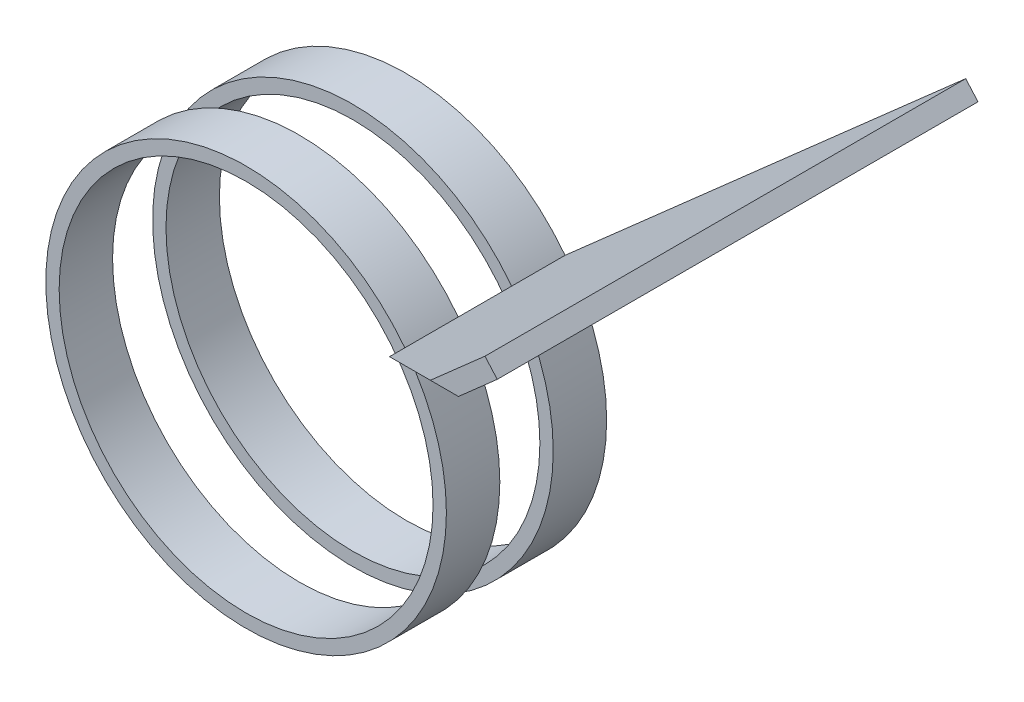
from build123d import *

# Parameters (mm, degrees)
SKETCH1_R           = 37.5
BOSS_EXTRUDE1_DEPTH = 10
SKETCH2_R           = 35
CUT_EXTRUDE1_DEPTH  = 10
BOSS_EXTRUDE2_DEPTH = 60
CUT_EXTRUDE2_DEPTH  = 100
SKETCH7_W           = 30
SKETCH7_H           = 75
CUT_EXTRUDE3_DEPTH  = 100
BOSS_EXTRUDE3_START = -10
SKETCH8_R           = 37.5
BOSS_EXTRUDE3_DEPTH = 10
SKETCH11_R          = 35
CUT_EXTRUDE5_DEPTH  = 161.550713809


with BuildPart() as part:
    # Sketch1 → Boss-Extrude1 (new body)
    with BuildSketch(Plane.XY):
        Circle(SKETCH1_R)
    extrude(amount=BOSS_EXTRUDE1_DEPTH)

    # Sketch2 → Cut-Extrude1 (cut)
    with BuildSketch(Plane.XY.offset(10)):
        Circle(SKETCH2_R)
    extrude(amount=-CUT_EXTRUDE1_DEPTH, mode=Mode.SUBTRACT)

    # Sketch5 → Boss-Extrude2 (add, symmetric)
    with BuildSketch(Plane.XY.offset(10)):
        Polygon((29.718646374, 22.870331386), (104.718646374, 89.014114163), (107.018779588, 86.406008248), (31.721443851, 20), align=None)
    extrude(amount=BOSS_EXTRUDE2_DEPTH, both=True)

    # Sketch6 → Cut-Extrude2 (cut)
    with BuildSketch(Plane(origin=(107.018779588, 0, 0), x_dir=(0, 0, -1), z_dir=(1, 0, 0))):
        Polygon((-10, 20), (-70, 80), (-70, 20), align=None)
    extrude(amount=-CUT_EXTRUDE2_DEPTH, mode=Mode.SUBTRACT)

    # Sketch7 → Cut-Extrude3 (cut)
    with BuildSketch(Plane(origin=(107.018779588, 0, 0), x_dir=(0, 0, -1), z_dir=(1, 0, 0))):
        with Locations((35, 57.5)):
            Rectangle(SKETCH7_W, SKETCH7_H)
    extrude(amount=-CUT_EXTRUDE3_DEPTH, mode=Mode.SUBTRACT)

    # Sketch8 → Boss-Extrude3 (add)
    with BuildSketch(Plane.XY.offset(-10).offset(BOSS_EXTRUDE3_START)):
        Circle(SKETCH8_R)
    extrude(amount=BOSS_EXTRUDE3_DEPTH)

    # Sketch11 → Cut-Extrude5 (cut, through all)
    with BuildSketch(Plane.XY.offset(-10)):
        Circle(SKETCH11_R)
    extrude(amount=-CUT_EXTRUDE5_DEPTH, mode=Mode.SUBTRACT)


solid = part.part
